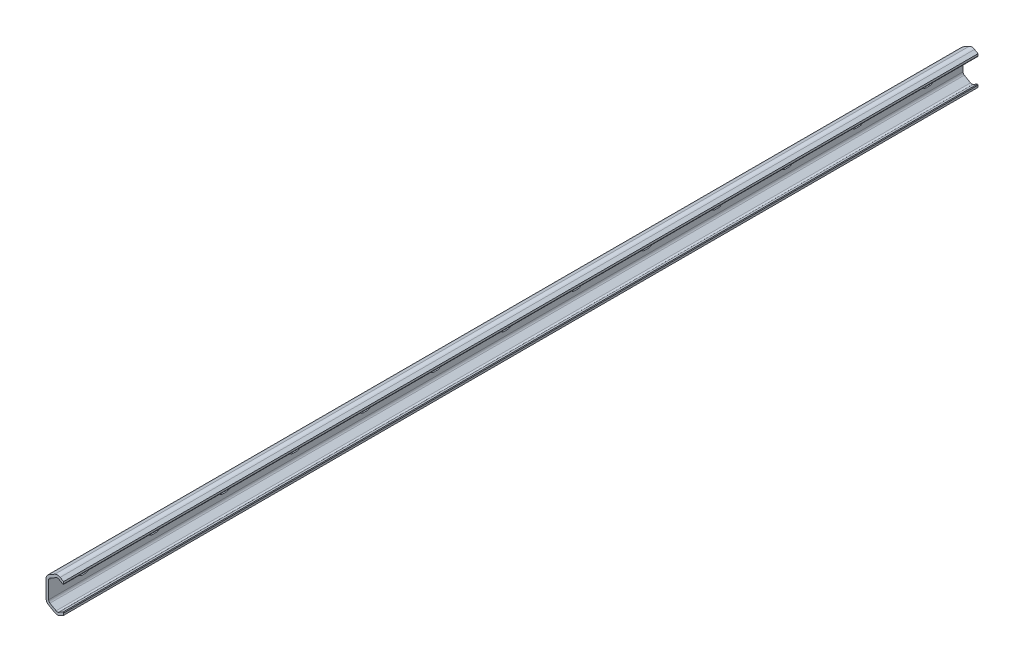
from build123d import *

# Parameters (mm, degrees)
BOSS_EXTRUDE1_DEPTH = 1040
CUT_EXTRUDE1_DEPTH  = 1041.326687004
LPATTERN1_COUNT     = 13
LPATTERN1_PITCH     = 80


with BuildPart() as part:
    # Sketch1 → Boss-Extrude1 (new body)
    with BuildSketch(Plane.XY):
        with BuildLine():
            Line((19.499613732, 13.474805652), (19.999997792, 14.341496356))
            Line((19.999997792, 14.341496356), (19.999997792, 16.649985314))
            Line((19.999997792, 16.649985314), (16.076193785, 18.915394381))
            ThreePointArc((16.076193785, 18.915394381), (13.043994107, 19.73984446), (9.999984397, 18.960128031))
            Line((9.999984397, 18.960128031), (2.999981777, 14.918641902))
            ThreePointArc((2.999981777, 14.918641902), (0.803842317, 12.722490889), (0, 9.7225))
            Line((0, 9.7225), (0, 0))
            Line((0, 0), (0, -9.7225))
            ThreePointArc((0, -9.7225), (0.803842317, -12.722490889), (2.999981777, -14.918641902))
            Line((2.999981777, -14.918641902), (9.999984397, -18.960128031))
            ThreePointArc((9.999984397, -18.960128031), (13.044170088, -19.763823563), (16.076193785, -18.915398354))
            Line((16.076193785, -18.915398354), (19.999997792, -16.649989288))
            Line((19.999997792, -16.649989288), (19.999997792, -14.34150033))
            Line((19.999997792, -14.34150033), (19.499613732, -13.474809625))
            Line((19.499613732, -13.474809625), (14.553790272, -16.330281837))
            ThreePointArc((14.553790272, -16.330281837), (13.031057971, -16.746803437), (11.499984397, -16.362072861))
            Line((11.499984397, -16.362072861), (4.499981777, -12.320586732))
            ThreePointArc((4.499981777, -12.320586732), (3.401905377, -11.222504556), (2.999981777, -9.7225))
            Line((2.999981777, -9.7225), (2.999981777, 9.7225))
            ThreePointArc((2.999981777, 9.7225), (3.401905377, 11.222504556), (4.499981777, 12.320586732))
            Line((4.499981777, 12.320586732), (11.499984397, 16.362072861))
            ThreePointArc((11.499984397, 16.362072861), (13.031235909, 16.763841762), (14.553790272, 16.330277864))
            Line((14.553790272, 16.330277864), (19.499613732, 13.474805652))
        make_face()
    extrude(amount=-BOSS_EXTRUDE1_DEPTH)

    # Sketch2 → Cut-Extrude1 (cut, through all)
    with BuildSketch(Plane(origin=(2.999981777, 0, 0), x_dir=(0, 0, -1), z_dir=(1, 0, 0))):
        with BuildLine():
            Line((42, -4.5), (38, -4.5))
            ThreePointArc((38, -4.5), (33.5, 0), (38, 4.5))
            Line((38, 4.5), (42, 4.5))
            ThreePointArc((42, 4.5), (46.5, 0), (42, -4.5))
        make_face()
    cut_extrude1 = extrude(amount=-CUT_EXTRUDE1_DEPTH, mode=Mode.SUBTRACT)

    # LPattern1: Cut-Extrude1 ×13
    with Locations(*[(0, 0, -i * LPATTERN1_PITCH) for i in range(1, LPATTERN1_COUNT)]):
        add(cut_extrude1, mode=Mode.SUBTRACT)


solid = part.part
